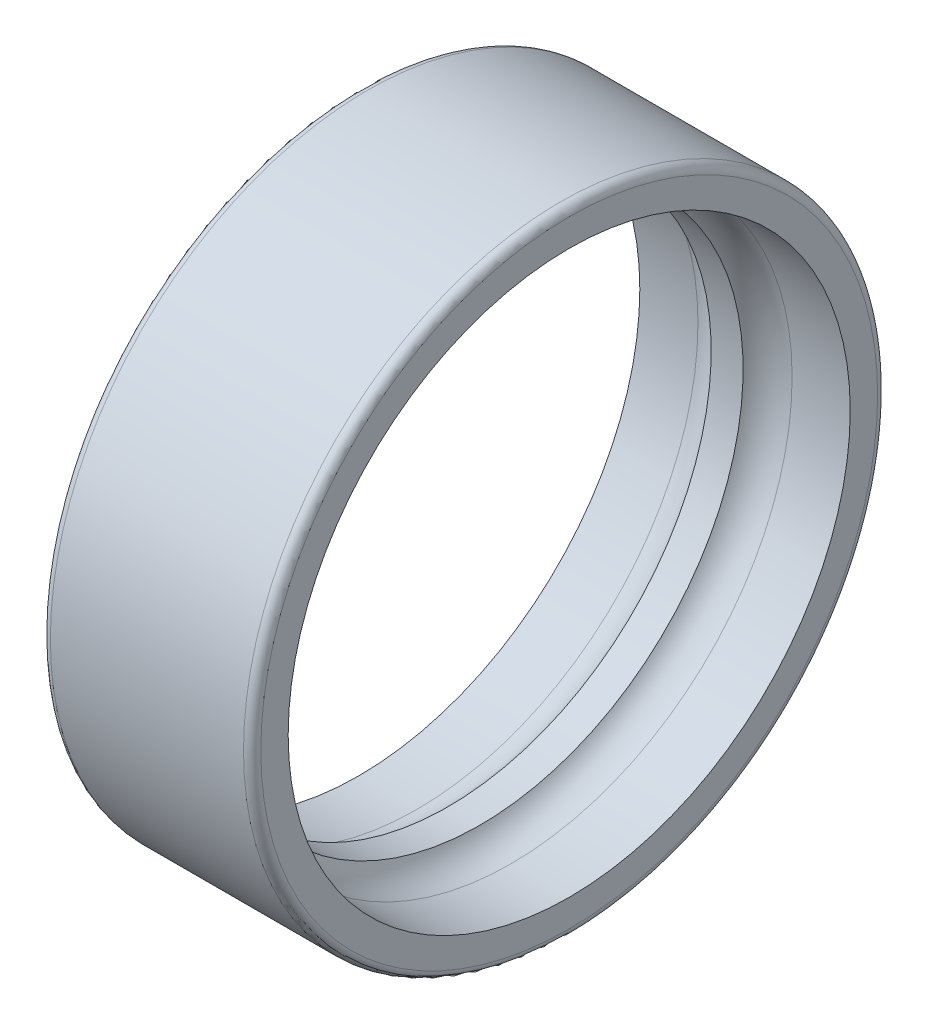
from build123d import *


with BuildPart() as part:
    # Esquisse1 → R_volution1 (revolve)
    with BuildSketch(Plane.XY, mode=Mode.PRIVATE) as r_volution1_sk:
        with BuildLine():
            Line((-16.75, 55), (16.75, 55))
            ThreePointArc((16.75, 55), (17.810660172, 54.560660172), (18.25, 53.5))
            Line((18.25, 53.5), (18.25, 48.75))
            Line((18.25, 48.75), (8.166666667, 48.75))
            ThreePointArc((8.166666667, 48.75), (5.054191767, 47.919870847), (2.768518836, 45.65))
            Line((2.768518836, 45.65), (-2.768518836, 45.65))
            ThreePointArc((-2.768518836, 45.65), (-5.054191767, 47.919870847), (-8.166666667, 48.75))
            Line((-8.166666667, 48.75), (-18.25, 48.75))
            Line((-18.25, 48.75), (-18.25, 53.5))
            ThreePointArc((-18.25, 53.5), (-17.810660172, 54.560660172), (-16.75, 55))
        make_face()
    revolve(r_volution1_sk.sketch.rotate(Axis((0, 0, 0), (1, 0, 0)), 90), axis=Axis((0, 0, 0), (1, 0, 0)))


solid = part.part
